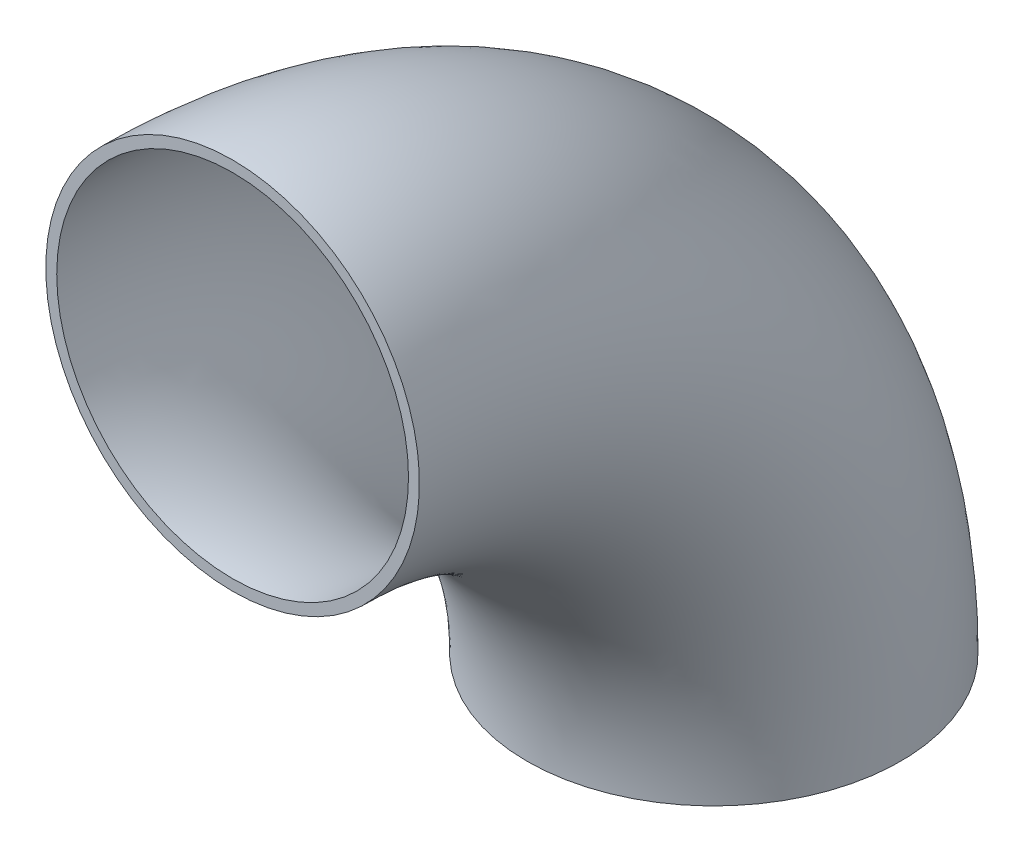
ISO-10303-21;
HEADER;
FILE_DESCRIPTION(('STEP AP214'),'2;1');
FILE_NAME('part.step','',(''),(''),'','','');
FILE_SCHEMA(('AUTOMOTIVE_DESIGN { 1 0 10303 214 1 1 1 1 }'));
ENDSEC;
DATA;
#1=APPLICATION_CONTEXT('core data for automotive mechanical design processes');
#2=APPLICATION_PROTOCOL_DEFINITION('international standard','automotive_design',2000,#1);
#3=PRODUCT_CONTEXT('',#1,'mechanical');
#4=PRODUCT('Part','Part','',(#3));
#5=PRODUCT_RELATED_PRODUCT_CATEGORY('part','',(#4));
#6=PRODUCT_DEFINITION_FORMATION('','',#4);
#7=PRODUCT_DEFINITION_CONTEXT('part definition',#1,'design');
#8=PRODUCT_DEFINITION('design','',#6,#7);
#9=PRODUCT_DEFINITION_SHAPE('','',#8);
#10=(LENGTH_UNIT() NAMED_UNIT(*) SI_UNIT(.MILLI.,.METRE.));
#11=(NAMED_UNIT(*) PLANE_ANGLE_UNIT() SI_UNIT($,.RADIAN.));
#12=(NAMED_UNIT(*) SI_UNIT($,.STERADIAN.) SOLID_ANGLE_UNIT());
#13=UNCERTAINTY_MEASURE_WITH_UNIT(LENGTH_MEASURE(1.E-05),#10,'distance_accuracy_value','');
#14=(GEOMETRIC_REPRESENTATION_CONTEXT(3) GLOBAL_UNCERTAINTY_ASSIGNED_CONTEXT((#13)) GLOBAL_UNIT_ASSIGNED_CONTEXT((#10,
#11,#12)) REPRESENTATION_CONTEXT('',''));
#15=CARTESIAN_POINT('',(0.,0.,0.));
#16=DIRECTION('',(0.,0.,1.));
#17=DIRECTION('',(1.,0.,0.));
#18=AXIS2_PLACEMENT_3D('',#15,#16,#17);
#19=CARTESIAN_POINT('',(0.,0.,0.));
#20=DIRECTION('',(-1.,0.,0.));
#21=DIRECTION('',(0.,0.,1.));
#22=AXIS2_PLACEMENT_3D('',#19,#20,#21);
#23=TOROIDAL_SURFACE('',#22,114.5,41.85);
#24=CARTESIAN_POINT('',(0.,114.5,-3.62948604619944E-13));
#25=DIRECTION('',(0.,0.,1.));
#26=DIRECTION('',(0.,-1.,0.));
#27=AXIS2_PLACEMENT_3D('',#24,#25,#26);
#28=CIRCLE('',#27,41.85);
#29=CARTESIAN_POINT('',(0.,156.35,-4.95607112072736E-13));
#30=VERTEX_POINT('',#29);
#31=EDGE_CURVE('E35',#30,#30,#28,.T.);
#32=CARTESIAN_POINT('',(0.,0.,-114.5));
#33=DIRECTION('',(0.,1.,0.));
#34=DIRECTION('',(0.,0.,1.));
#35=AXIS2_PLACEMENT_3D('',#32,#33,#34);
#36=CIRCLE('',#35,41.85);
#37=CARTESIAN_POINT('',(0.,0.,-156.35));
#38=VERTEX_POINT('',#37);
#39=EDGE_CURVE('E43',#38,#38,#36,.T.);
#40=CARTESIAN_POINT('',(0.,0.,0.));
#41=DIRECTION('',(-1.,0.,0.));
#42=DIRECTION('',(0.,0.,1.));
#43=AXIS2_PLACEMENT_3D('',#40,#41,#42);
#44=CIRCLE('',#43,156.35);
#45=EDGE_CURVE('',#30,#38,#44,.T.);
#46=ORIENTED_EDGE('',*,*,#31,.T.);
#47=ORIENTED_EDGE('',*,*,#39,.F.);
#48=ORIENTED_EDGE('',*,*,#45,.T.);
#49=ORIENTED_EDGE('',*,*,#45,.F.);
#50=EDGE_LOOP('',(#46,#48,#47,#49));
#51=FACE_BOUND('',#50,.T.);
#52=ADVANCED_FACE('F28',(#51),#23,.F.);
#53=CARTESIAN_POINT('',(0.,0.,0.));
#54=DIRECTION('',(-1.,0.,0.));
#55=DIRECTION('',(0.,0.,1.));
#56=AXIS2_PLACEMENT_3D('',#53,#54,#55);
#57=TOROIDAL_SURFACE('',#56,114.5,44.45);
#58=CARTESIAN_POINT('',(0.,114.5,-3.62948604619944E-13));
#59=DIRECTION('',(0.,0.,1.));
#60=DIRECTION('',(0.,-1.,0.));
#61=AXIS2_PLACEMENT_3D('',#58,#59,#60);
#62=CIRCLE('',#61,44.45);
#63=CARTESIAN_POINT('',(0.,158.95,-5.03848739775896E-13));
#64=VERTEX_POINT('',#63);
#65=EDGE_CURVE('E10',#64,#64,#62,.T.);
#66=CARTESIAN_POINT('',(0.,0.,-114.5));
#67=DIRECTION('',(0.,1.,0.));
#68=DIRECTION('',(0.,0.,1.));
#69=AXIS2_PLACEMENT_3D('',#66,#67,#68);
#70=CIRCLE('',#69,44.45);
#71=CARTESIAN_POINT('',(0.,0.,-158.95));
#72=VERTEX_POINT('',#71);
#73=EDGE_CURVE('E39',#72,#72,#70,.T.);
#74=CARTESIAN_POINT('',(0.,0.,0.));
#75=DIRECTION('',(-1.,0.,0.));
#76=DIRECTION('',(0.,0.,1.));
#77=AXIS2_PLACEMENT_3D('',#74,#75,#76);
#78=CIRCLE('',#77,158.95);
#79=EDGE_CURVE('',#64,#72,#78,.T.);
#80=ORIENTED_EDGE('',*,*,#65,.F.);
#81=ORIENTED_EDGE('',*,*,#73,.T.);
#82=ORIENTED_EDGE('',*,*,#79,.T.);
#83=ORIENTED_EDGE('',*,*,#79,.F.);
#84=EDGE_LOOP('',(#80,#82,#81,#83));
#85=FACE_BOUND('',#84,.T.);
#86=ADVANCED_FACE('F30',(#85),#57,.T.);
#87=CARTESIAN_POINT('',(0.,114.5,-3.62948604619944E-13));
#88=DIRECTION('',(0.,0.,1.));
#89=DIRECTION('',(0.,-1.,0.));
#90=AXIS2_PLACEMENT_3D('',#87,#88,#89);
#91=PLANE('',#90);
#92=ORIENTED_EDGE('',*,*,#31,.F.);
#93=EDGE_LOOP('',(#92));
#94=FACE_BOUND('',#93,.T.);
#95=ORIENTED_EDGE('',*,*,#65,.T.);
#96=EDGE_LOOP('',(#95));
#97=FACE_BOUND('',#96,.T.);
#98=ADVANCED_FACE('F53',(#94,#97),#91,.T.);
#99=CARTESIAN_POINT('',(0.,0.,-114.5));
#100=DIRECTION('',(0.,1.,0.));
#101=DIRECTION('',(0.,0.,1.));
#102=AXIS2_PLACEMENT_3D('',#99,#100,#101);
#103=PLANE('',#102);
#104=ORIENTED_EDGE('',*,*,#39,.T.);
#105=EDGE_LOOP('',(#104));
#106=FACE_BOUND('',#105,.T.);
#107=ORIENTED_EDGE('',*,*,#73,.F.);
#108=EDGE_LOOP('',(#107));
#109=FACE_BOUND('',#108,.T.);
#110=ADVANCED_FACE('F49',(#106,#109),#103,.F.);
#111=CLOSED_SHELL('',(#52,#86,#98,#110));
#112=MANIFOLD_SOLID_BREP('B2',#111);
#113=ADVANCED_BREP_SHAPE_REPRESENTATION('',(#18,#112),#14);
#114=SHAPE_DEFINITION_REPRESENTATION(#9,#113);
ENDSEC;
END-ISO-10303-21;
